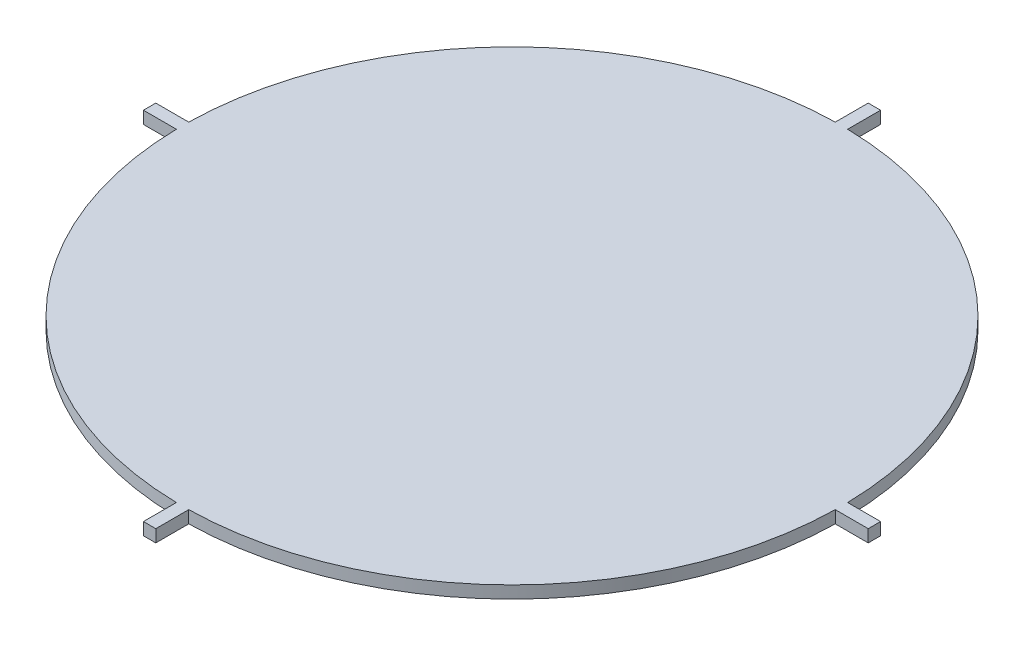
ISO-10303-21;
HEADER;
FILE_DESCRIPTION(('STEP AP214'),'2;1');
FILE_NAME('part.step','',(''),(''),'','','');
FILE_SCHEMA(('AUTOMOTIVE_DESIGN { 1 0 10303 214 1 1 1 1 }'));
ENDSEC;
DATA;
#1=APPLICATION_CONTEXT('core data for automotive mechanical design processes');
#2=APPLICATION_PROTOCOL_DEFINITION('international standard','automotive_design',2000,#1);
#3=PRODUCT_CONTEXT('',#1,'mechanical');
#4=PRODUCT('Part','Part','',(#3));
#5=PRODUCT_RELATED_PRODUCT_CATEGORY('part','',(#4));
#6=PRODUCT_DEFINITION_FORMATION('','',#4);
#7=PRODUCT_DEFINITION_CONTEXT('part definition',#1,'design');
#8=PRODUCT_DEFINITION('design','',#6,#7);
#9=PRODUCT_DEFINITION_SHAPE('','',#8);
#10=(LENGTH_UNIT() NAMED_UNIT(*) SI_UNIT(.MILLI.,.METRE.));
#11=(NAMED_UNIT(*) PLANE_ANGLE_UNIT() SI_UNIT($,.RADIAN.));
#12=(NAMED_UNIT(*) SI_UNIT($,.STERADIAN.) SOLID_ANGLE_UNIT());
#13=UNCERTAINTY_MEASURE_WITH_UNIT(LENGTH_MEASURE(1.E-05),#10,'distance_accuracy_value','');
#14=(GEOMETRIC_REPRESENTATION_CONTEXT(3) GLOBAL_UNCERTAINTY_ASSIGNED_CONTEXT((#13)) GLOBAL_UNIT_ASSIGNED_CONTEXT((#10,
#11,#12)) REPRESENTATION_CONTEXT('',''));
#15=CARTESIAN_POINT('',(0.,0.,0.));
#16=DIRECTION('',(0.,0.,1.));
#17=DIRECTION('',(1.,0.,0.));
#18=AXIS2_PLACEMENT_3D('',#15,#16,#17);
#19=CARTESIAN_POINT('',(0.,3.,-1.50000000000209));
#20=DIRECTION('',(0.,0.,1.));
#21=DIRECTION('',(1.,0.,0.));
#22=AXIS2_PLACEMENT_3D('',#19,#20,#21);
#23=PLANE('',#22);
#24=DIRECTION('',(-1.,0.,0.));
#25=VECTOR('',#24,1.);
#26=CARTESIAN_POINT('',(0.,0.,-1.50000000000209));
#27=LINE('',#26,#25);
#28=CARTESIAN_POINT('',(87.9859362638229,0.,-1.5000000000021));
#29=VERTEX_POINT('',#28);
#30=CARTESIAN_POINT('',(79.9859362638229,0.,-1.5000000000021));
#31=VERTEX_POINT('',#30);
#32=EDGE_CURVE('E181',#29,#31,#27,.T.);
#33=ORIENTED_EDGE('',*,*,#32,.T.);
#34=DIRECTION('',(0.,-1.,0.));
#35=VECTOR('',#34,1.);
#36=CARTESIAN_POINT('',(79.9859362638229,3.,-1.5000000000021));
#37=LINE('',#36,#35);
#38=CARTESIAN_POINT('',(79.9859362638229,3.,-1.5000000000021));
#39=VERTEX_POINT('',#38);
#40=EDGE_CURVE('E11',#39,#31,#37,.T.);
#41=ORIENTED_EDGE('',*,*,#40,.F.);
#42=DIRECTION('',(-1.,0.,0.));
#43=VECTOR('',#42,1.);
#44=CARTESIAN_POINT('',(0.,3.,-1.50000000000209));
#45=LINE('',#44,#43);
#46=CARTESIAN_POINT('',(87.9859362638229,3.,-1.5000000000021));
#47=VERTEX_POINT('',#46);
#48=EDGE_CURVE('E222',#47,#39,#45,.T.);
#49=ORIENTED_EDGE('',*,*,#48,.F.);
#50=DIRECTION('',(0.,-1.,0.));
#51=VECTOR('',#50,1.);
#52=CARTESIAN_POINT('',(87.9859362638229,3.,-1.5000000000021));
#53=LINE('',#52,#51);
#54=EDGE_CURVE('E51',#47,#29,#53,.T.);
#55=ORIENTED_EDGE('',*,*,#54,.T.);
#56=EDGE_LOOP('',(#33,#41,#49,#55));
#57=FACE_BOUND('',#56,.T.);
#58=ADVANCED_FACE('F35',(#57),#23,.F.);
#59=CARTESIAN_POINT('',(0.,3.,0.));
#60=DIRECTION('',(0.,-1.,0.));
#61=DIRECTION('',(0.,0.,-1.));
#62=AXIS2_PLACEMENT_3D('',#59,#60,#61);
#63=CYLINDRICAL_SURFACE('',#62,80.0000000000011);
#64=CARTESIAN_POINT('',(0.,0.,0.));
#65=DIRECTION('',(0.,1.,0.));
#66=DIRECTION('',(0.,0.,1.));
#67=AXIS2_PLACEMENT_3D('',#64,#65,#66);
#68=CIRCLE('',#67,80.0000000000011);
#69=CARTESIAN_POINT('',(1.50000000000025,0.,-79.9859362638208));
#70=VERTEX_POINT('',#69);
#71=EDGE_CURVE('E183',#31,#70,#68,.T.);
#72=ORIENTED_EDGE('',*,*,#71,.T.);
#73=DIRECTION('',(0.,-1.,0.));
#74=VECTOR('',#73,1.);
#75=CARTESIAN_POINT('',(1.50000000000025,3.,-79.9859362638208));
#76=LINE('',#75,#74);
#77=CARTESIAN_POINT('',(1.50000000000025,3.,-79.9859362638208));
#78=VERTEX_POINT('',#77);
#79=EDGE_CURVE('E43',#78,#70,#76,.T.);
#80=ORIENTED_EDGE('',*,*,#79,.F.);
#81=CARTESIAN_POINT('',(0.,3.,0.));
#82=DIRECTION('',(0.,1.,0.));
#83=DIRECTION('',(0.,0.,1.));
#84=AXIS2_PLACEMENT_3D('',#81,#82,#83);
#85=CIRCLE('',#84,80.0000000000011);
#86=EDGE_CURVE('E113',#39,#78,#85,.T.);
#87=ORIENTED_EDGE('',*,*,#86,.F.);
#88=ORIENTED_EDGE('',*,*,#40,.T.);
#89=EDGE_LOOP('',(#72,#80,#87,#88));
#90=FACE_BOUND('',#89,.T.);
#91=ADVANCED_FACE('F253',(#90),#63,.T.);
#92=CARTESIAN_POINT('',(1.49999999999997,3.,0.));
#93=DIRECTION('',(1.,0.,0.));
#94=DIRECTION('',(0.,0.,-1.));
#95=AXIS2_PLACEMENT_3D('',#92,#93,#94);
#96=PLANE('',#95);
#97=DIRECTION('',(0.,0.,1.));
#98=VECTOR('',#97,1.);
#99=CARTESIAN_POINT('',(1.49999999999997,0.,0.));
#100=LINE('',#99,#98);
#101=CARTESIAN_POINT('',(1.50000000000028,0.,-87.9859362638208));
#102=VERTEX_POINT('',#101);
#103=EDGE_CURVE('E186',#102,#70,#100,.T.);
#104=ORIENTED_EDGE('',*,*,#103,.F.);
#105=DIRECTION('',(0.,-1.,0.));
#106=VECTOR('',#105,1.);
#107=CARTESIAN_POINT('',(1.50000000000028,3.,-87.9859362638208));
#108=LINE('',#107,#106);
#109=CARTESIAN_POINT('',(1.50000000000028,3.,-87.9859362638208));
#110=VERTEX_POINT('',#109);
#111=EDGE_CURVE('E246',#110,#102,#108,.T.);
#112=ORIENTED_EDGE('',*,*,#111,.F.);
#113=DIRECTION('',(0.,0.,1.));
#114=VECTOR('',#113,1.);
#115=CARTESIAN_POINT('',(1.49999999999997,3.,0.));
#116=LINE('',#115,#114);
#117=EDGE_CURVE('E252',#110,#78,#116,.T.);
#118=ORIENTED_EDGE('',*,*,#117,.T.);
#119=ORIENTED_EDGE('',*,*,#79,.T.);
#120=EDGE_LOOP('',(#104,#112,#118,#119));
#121=FACE_BOUND('',#120,.T.);
#122=ADVANCED_FACE('F250',(#121),#96,.T.);
#123=CARTESIAN_POINT('',(0.,3.,-87.9859362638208));
#124=DIRECTION('',(0.,0.,-1.));
#125=DIRECTION('',(-1.,0.,0.));
#126=AXIS2_PLACEMENT_3D('',#123,#124,#125);
#127=PLANE('',#126);
#128=DIRECTION('',(1.,0.,0.));
#129=VECTOR('',#128,1.);
#130=CARTESIAN_POINT('',(0.,0.,-87.9859362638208));
#131=LINE('',#130,#129);
#132=CARTESIAN_POINT('',(-1.49999999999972,0.,-87.9859362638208));
#133=VERTEX_POINT('',#132);
#134=EDGE_CURVE('E189',#133,#102,#131,.T.);
#135=ORIENTED_EDGE('',*,*,#134,.F.);
#136=DIRECTION('',(0.,-1.,0.));
#137=VECTOR('',#136,1.);
#138=CARTESIAN_POINT('',(-1.49999999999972,3.,-87.9859362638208));
#139=LINE('',#138,#137);
#140=CARTESIAN_POINT('',(-1.49999999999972,3.,-87.9859362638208));
#141=VERTEX_POINT('',#140);
#142=EDGE_CURVE('E244',#141,#133,#139,.T.);
#143=ORIENTED_EDGE('',*,*,#142,.F.);
#144=DIRECTION('',(1.,0.,0.));
#145=VECTOR('',#144,1.);
#146=CARTESIAN_POINT('',(0.,3.,-87.9859362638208));
#147=LINE('',#146,#145);
#148=EDGE_CURVE('E265',#141,#110,#147,.T.);
#149=ORIENTED_EDGE('',*,*,#148,.T.);
#150=ORIENTED_EDGE('',*,*,#111,.T.);
#151=EDGE_LOOP('',(#135,#143,#149,#150));
#152=FACE_BOUND('',#151,.T.);
#153=ADVANCED_FACE('F261',(#152),#127,.T.);
#154=CARTESIAN_POINT('',(-1.50000000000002,3.,0.));
#155=DIRECTION('',(1.,0.,0.));
#156=DIRECTION('',(0.,0.,-1.));
#157=AXIS2_PLACEMENT_3D('',#154,#155,#156);
#158=PLANE('',#157);
#159=DIRECTION('',(0.,0.,1.));
#160=VECTOR('',#159,1.);
#161=CARTESIAN_POINT('',(-1.50000000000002,0.,0.));
#162=LINE('',#161,#160);
#163=CARTESIAN_POINT('',(-1.49999999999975,0.,-79.9859362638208));
#164=VERTEX_POINT('',#163);
#165=EDGE_CURVE('E192',#133,#164,#162,.T.);
#166=ORIENTED_EDGE('',*,*,#165,.T.);
#167=DIRECTION('',(0.,-1.,0.));
#168=VECTOR('',#167,1.);
#169=CARTESIAN_POINT('',(-1.49999999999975,3.,-79.9859362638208));
#170=LINE('',#169,#168);
#171=CARTESIAN_POINT('',(-1.49999999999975,3.,-79.9859362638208));
#172=VERTEX_POINT('',#171);
#173=EDGE_CURVE('E241',#172,#164,#170,.T.);
#174=ORIENTED_EDGE('',*,*,#173,.F.);
#175=DIRECTION('',(0.,0.,1.));
#176=VECTOR('',#175,1.);
#177=CARTESIAN_POINT('',(-1.50000000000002,3.,0.));
#178=LINE('',#177,#176);
#179=EDGE_CURVE('E267',#141,#172,#178,.T.);
#180=ORIENTED_EDGE('',*,*,#179,.F.);
#181=ORIENTED_EDGE('',*,*,#142,.T.);
#182=EDGE_LOOP('',(#166,#174,#180,#181));
#183=FACE_BOUND('',#182,.T.);
#184=ADVANCED_FACE('F421',(#183),#158,.F.);
#185=CARTESIAN_POINT('',(0.,3.,0.));
#186=DIRECTION('',(0.,-1.,0.));
#187=DIRECTION('',(0.,0.,-1.));
#188=AXIS2_PLACEMENT_3D('',#185,#186,#187);
#189=CYLINDRICAL_SURFACE('',#188,80.);
#190=CARTESIAN_POINT('',(0.,0.,0.));
#191=DIRECTION('',(0.,1.,0.));
#192=DIRECTION('',(0.,0.,1.));
#193=AXIS2_PLACEMENT_3D('',#190,#191,#192);
#194=CIRCLE('',#193,80.);
#195=CARTESIAN_POINT('',(-79.9859362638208,0.,-1.49999999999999));
#196=VERTEX_POINT('',#195);
#197=EDGE_CURVE('E194',#164,#196,#194,.T.);
#198=ORIENTED_EDGE('',*,*,#197,.T.);
#199=DIRECTION('',(0.,-1.,0.));
#200=VECTOR('',#199,1.);
#201=CARTESIAN_POINT('',(-79.9859362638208,3.,-1.49999999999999));
#202=LINE('',#201,#200);
#203=CARTESIAN_POINT('',(-79.9859362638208,3.,-1.49999999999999));
#204=VERTEX_POINT('',#203);
#205=EDGE_CURVE('E239',#204,#196,#202,.T.);
#206=ORIENTED_EDGE('',*,*,#205,.F.);
#207=CARTESIAN_POINT('',(0.,3.,0.));
#208=DIRECTION('',(0.,1.,0.));
#209=DIRECTION('',(0.,0.,1.));
#210=AXIS2_PLACEMENT_3D('',#207,#208,#209);
#211=CIRCLE('',#210,80.);
#212=EDGE_CURVE('E273',#172,#204,#211,.T.);
#213=ORIENTED_EDGE('',*,*,#212,.F.);
#214=ORIENTED_EDGE('',*,*,#173,.T.);
#215=EDGE_LOOP('',(#198,#206,#213,#214));
#216=FACE_BOUND('',#215,.T.);
#217=ADVANCED_FACE('F411',(#216),#189,.T.);
#218=CARTESIAN_POINT('',(0.,3.,-1.49999999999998));
#219=DIRECTION('',(0.,0.,-1.));
#220=DIRECTION('',(-1.,0.,0.));
#221=AXIS2_PLACEMENT_3D('',#218,#219,#220);
#222=PLANE('',#221);
#223=DIRECTION('',(1.,0.,0.));
#224=VECTOR('',#223,1.);
#225=CARTESIAN_POINT('',(0.,0.,-1.49999999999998));
#226=LINE('',#225,#224);
#227=CARTESIAN_POINT('',(-87.9859362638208,0.,-1.49999999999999));
#228=VERTEX_POINT('',#227);
#229=EDGE_CURVE('E197',#228,#196,#226,.T.);
#230=ORIENTED_EDGE('',*,*,#229,.F.);
#231=DIRECTION('',(0.,-1.,0.));
#232=VECTOR('',#231,1.);
#233=CARTESIAN_POINT('',(-87.9859362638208,3.,-1.49999999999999));
#234=LINE('',#233,#232);
#235=CARTESIAN_POINT('',(-87.9859362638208,3.,-1.49999999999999));
#236=VERTEX_POINT('',#235);
#237=EDGE_CURVE('E237',#236,#228,#234,.T.);
#238=ORIENTED_EDGE('',*,*,#237,.F.);
#239=DIRECTION('',(1.,0.,0.));
#240=VECTOR('',#239,1.);
#241=CARTESIAN_POINT('',(0.,3.,-1.49999999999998));
#242=LINE('',#241,#240);
#243=EDGE_CURVE('E275',#236,#204,#242,.T.);
#244=ORIENTED_EDGE('',*,*,#243,.T.);
#245=ORIENTED_EDGE('',*,*,#205,.T.);
#246=EDGE_LOOP('',(#230,#238,#244,#245));
#247=FACE_BOUND('',#246,.T.);
#248=ADVANCED_FACE('F401',(#247),#222,.T.);
#249=CARTESIAN_POINT('',(-87.9859362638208,3.,0.));
#250=DIRECTION('',(-1.,0.,0.));
#251=DIRECTION('',(0.,0.,1.));
#252=AXIS2_PLACEMENT_3D('',#249,#250,#251);
#253=PLANE('',#252);
#254=DIRECTION('',(0.,0.,-1.));
#255=VECTOR('',#254,1.);
#256=CARTESIAN_POINT('',(-87.9859362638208,0.,0.));
#257=LINE('',#256,#255);
#258=CARTESIAN_POINT('',(-87.9859362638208,0.,1.50000000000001));
#259=VERTEX_POINT('',#258);
#260=EDGE_CURVE('E200',#259,#228,#257,.T.);
#261=ORIENTED_EDGE('',*,*,#260,.F.);
#262=DIRECTION('',(0.,-1.,0.));
#263=VECTOR('',#262,1.);
#264=CARTESIAN_POINT('',(-87.9859362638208,3.,1.50000000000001));
#265=LINE('',#264,#263);
#266=CARTESIAN_POINT('',(-87.9859362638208,3.,1.50000000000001));
#267=VERTEX_POINT('',#266);
#268=EDGE_CURVE('E235',#267,#259,#265,.T.);
#269=ORIENTED_EDGE('',*,*,#268,.F.);
#270=DIRECTION('',(0.,0.,-1.));
#271=VECTOR('',#270,1.);
#272=CARTESIAN_POINT('',(-87.9859362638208,3.,0.));
#273=LINE('',#272,#271);
#274=EDGE_CURVE('E278',#267,#236,#273,.T.);
#275=ORIENTED_EDGE('',*,*,#274,.T.);
#276=ORIENTED_EDGE('',*,*,#237,.T.);
#277=EDGE_LOOP('',(#261,#269,#275,#276));
#278=FACE_BOUND('',#277,.T.);
#279=ADVANCED_FACE('F391',(#278),#253,.T.);
#280=CARTESIAN_POINT('',(0.,3.,1.50000000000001));
#281=DIRECTION('',(0.,0.,-1.));
#282=DIRECTION('',(-1.,0.,0.));
#283=AXIS2_PLACEMENT_3D('',#280,#281,#282);
#284=PLANE('',#283);
#285=DIRECTION('',(1.,0.,0.));
#286=VECTOR('',#285,1.);
#287=CARTESIAN_POINT('',(0.,0.,1.50000000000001));
#288=LINE('',#287,#286);
#289=CARTESIAN_POINT('',(-79.9859362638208,0.,1.50000000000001));
#290=VERTEX_POINT('',#289);
#291=EDGE_CURVE('E203',#259,#290,#288,.T.);
#292=ORIENTED_EDGE('',*,*,#291,.T.);
#293=DIRECTION('',(0.,-1.,0.));
#294=VECTOR('',#293,1.);
#295=CARTESIAN_POINT('',(-79.9859362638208,3.,1.50000000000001));
#296=LINE('',#295,#294);
#297=CARTESIAN_POINT('',(-79.9859362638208,3.,1.50000000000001));
#298=VERTEX_POINT('',#297);
#299=EDGE_CURVE('E232',#298,#290,#296,.T.);
#300=ORIENTED_EDGE('',*,*,#299,.F.);
#301=DIRECTION('',(1.,0.,0.));
#302=VECTOR('',#301,1.);
#303=CARTESIAN_POINT('',(0.,3.,1.50000000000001));
#304=LINE('',#303,#302);
#305=EDGE_CURVE('E281',#267,#298,#304,.T.);
#306=ORIENTED_EDGE('',*,*,#305,.F.);
#307=ORIENTED_EDGE('',*,*,#268,.T.);
#308=EDGE_LOOP('',(#292,#300,#306,#307));
#309=FACE_BOUND('',#308,.T.);
#310=ADVANCED_FACE('F381',(#309),#284,.F.);
#311=CARTESIAN_POINT('',(0.,3.,0.));
#312=DIRECTION('',(0.,-1.,0.));
#313=DIRECTION('',(0.,0.,-1.));
#314=AXIS2_PLACEMENT_3D('',#311,#312,#313);
#315=CYLINDRICAL_SURFACE('',#314,80.);
#316=CARTESIAN_POINT('',(0.,0.,0.));
#317=DIRECTION('',(0.,1.,0.));
#318=DIRECTION('',(0.,0.,1.));
#319=AXIS2_PLACEMENT_3D('',#316,#317,#318);
#320=CIRCLE('',#319,80.);
#321=CARTESIAN_POINT('',(-1.50000000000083,0.,79.9859362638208));
#322=VERTEX_POINT('',#321);
#323=EDGE_CURVE('E205',#290,#322,#320,.T.);
#324=ORIENTED_EDGE('',*,*,#323,.T.);
#325=DIRECTION('',(0.,-1.,0.));
#326=VECTOR('',#325,1.);
#327=CARTESIAN_POINT('',(-1.50000000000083,3.,79.9859362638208));
#328=LINE('',#327,#326);
#329=CARTESIAN_POINT('',(-1.50000000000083,3.,79.9859362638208));
#330=VERTEX_POINT('',#329);
#331=EDGE_CURVE('E230',#330,#322,#328,.T.);
#332=ORIENTED_EDGE('',*,*,#331,.F.);
#333=CARTESIAN_POINT('',(0.,3.,0.));
#334=DIRECTION('',(0.,1.,0.));
#335=DIRECTION('',(0.,0.,1.));
#336=AXIS2_PLACEMENT_3D('',#333,#334,#335);
#337=CIRCLE('',#336,80.);
#338=EDGE_CURVE('E283',#298,#330,#337,.T.);
#339=ORIENTED_EDGE('',*,*,#338,.F.);
#340=ORIENTED_EDGE('',*,*,#299,.T.);
#341=EDGE_LOOP('',(#324,#332,#339,#340));
#342=FACE_BOUND('',#341,.T.);
#343=ADVANCED_FACE('F371',(#342),#315,.T.);
#344=CARTESIAN_POINT('',(-1.49999999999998,3.,0.));
#345=DIRECTION('',(-1.,0.,0.));
#346=DIRECTION('',(0.,0.,1.));
#347=AXIS2_PLACEMENT_3D('',#344,#345,#346);
#348=PLANE('',#347);
#349=DIRECTION('',(0.,0.,-1.));
#350=VECTOR('',#349,1.);
#351=CARTESIAN_POINT('',(-1.49999999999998,0.,0.));
#352=LINE('',#351,#350);
#353=CARTESIAN_POINT('',(-1.50000000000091,0.,87.9859362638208));
#354=VERTEX_POINT('',#353);
#355=EDGE_CURVE('E208',#354,#322,#352,.T.);
#356=ORIENTED_EDGE('',*,*,#355,.F.);
#357=DIRECTION('',(0.,-1.,0.));
#358=VECTOR('',#357,1.);
#359=CARTESIAN_POINT('',(-1.50000000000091,3.,87.9859362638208));
#360=LINE('',#359,#358);
#361=CARTESIAN_POINT('',(-1.50000000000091,3.,87.9859362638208));
#362=VERTEX_POINT('',#361);
#363=EDGE_CURVE('E228',#362,#354,#360,.T.);
#364=ORIENTED_EDGE('',*,*,#363,.F.);
#365=DIRECTION('',(0.,0.,-1.));
#366=VECTOR('',#365,1.);
#367=CARTESIAN_POINT('',(-1.49999999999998,3.,0.));
#368=LINE('',#367,#366);
#369=EDGE_CURVE('E285',#362,#330,#368,.T.);
#370=ORIENTED_EDGE('',*,*,#369,.T.);
#371=ORIENTED_EDGE('',*,*,#331,.T.);
#372=EDGE_LOOP('',(#356,#364,#370,#371));
#373=FACE_BOUND('',#372,.T.);
#374=ADVANCED_FACE('F298',(#373),#348,.T.);
#375=CARTESIAN_POINT('',(-8.14033435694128E-13,3.,87.9859362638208));
#376=DIRECTION('',(0.,0.,1.));
#377=DIRECTION('',(1.,0.,0.));
#378=AXIS2_PLACEMENT_3D('',#375,#376,#377);
#379=PLANE('',#378);
#380=DIRECTION('',(-1.,0.,0.));
#381=VECTOR('',#380,1.);
#382=CARTESIAN_POINT('',(-8.14033435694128E-13,0.,87.9859362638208));
#383=LINE('',#382,#381);
#384=CARTESIAN_POINT('',(1.49999999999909,0.,87.9859362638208));
#385=VERTEX_POINT('',#384);
#386=EDGE_CURVE('E211',#385,#354,#383,.T.);
#387=ORIENTED_EDGE('',*,*,#386,.F.);
#388=DIRECTION('',(0.,-1.,0.));
#389=VECTOR('',#388,1.);
#390=CARTESIAN_POINT('',(1.49999999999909,3.,87.9859362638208));
#391=LINE('',#390,#389);
#392=CARTESIAN_POINT('',(1.49999999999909,3.,87.9859362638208));
#393=VERTEX_POINT('',#392);
#394=EDGE_CURVE('E226',#393,#385,#391,.T.);
#395=ORIENTED_EDGE('',*,*,#394,.F.);
#396=DIRECTION('',(-1.,0.,0.));
#397=VECTOR('',#396,1.);
#398=CARTESIAN_POINT('',(-8.14033435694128E-13,3.,87.9859362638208));
#399=LINE('',#398,#397);
#400=EDGE_CURVE('E288',#393,#362,#399,.T.);
#401=ORIENTED_EDGE('',*,*,#400,.T.);
#402=ORIENTED_EDGE('',*,*,#363,.T.);
#403=EDGE_LOOP('',(#387,#395,#401,#402));
#404=FACE_BOUND('',#403,.T.);
#405=ADVANCED_FACE('F292',(#404),#379,.T.);
#406=CARTESIAN_POINT('',(1.50000000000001,3.,0.));
#407=DIRECTION('',(-1.,0.,0.));
#408=DIRECTION('',(0.,0.,1.));
#409=AXIS2_PLACEMENT_3D('',#406,#407,#408);
#410=PLANE('',#409);
#411=DIRECTION('',(0.,0.,-1.));
#412=VECTOR('',#411,1.);
#413=CARTESIAN_POINT('',(1.50000000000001,0.,0.));
#414=LINE('',#413,#412);
#415=CARTESIAN_POINT('',(1.49999999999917,0.,79.9859362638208));
#416=VERTEX_POINT('',#415);
#417=EDGE_CURVE('E214',#385,#416,#414,.T.);
#418=ORIENTED_EDGE('',*,*,#417,.T.);
#419=DIRECTION('',(0.,-1.,0.));
#420=VECTOR('',#419,1.);
#421=CARTESIAN_POINT('',(1.49999999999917,3.,79.9859362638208));
#422=LINE('',#421,#420);
#423=CARTESIAN_POINT('',(1.49999999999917,3.,79.9859362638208));
#424=VERTEX_POINT('',#423);
#425=EDGE_CURVE('E173',#424,#416,#422,.T.);
#426=ORIENTED_EDGE('',*,*,#425,.F.);
#427=DIRECTION('',(0.,0.,-1.));
#428=VECTOR('',#427,1.);
#429=CARTESIAN_POINT('',(1.50000000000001,3.,0.));
#430=LINE('',#429,#428);
#431=EDGE_CURVE('E161',#393,#424,#430,.T.);
#432=ORIENTED_EDGE('',*,*,#431,.F.);
#433=ORIENTED_EDGE('',*,*,#394,.T.);
#434=EDGE_LOOP('',(#418,#426,#432,#433));
#435=FACE_BOUND('',#434,.T.);
#436=ADVANCED_FACE('F302',(#435),#410,.F.);
#437=CARTESIAN_POINT('',(0.,3.,0.));
#438=DIRECTION('',(0.,-1.,0.));
#439=DIRECTION('',(0.,0.,-1.));
#440=AXIS2_PLACEMENT_3D('',#437,#438,#439);
#441=CYLINDRICAL_SURFACE('',#440,80.0000000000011);
#442=CARTESIAN_POINT('',(0.,0.,0.));
#443=DIRECTION('',(0.,1.,0.));
#444=DIRECTION('',(0.,0.,1.));
#445=AXIS2_PLACEMENT_3D('',#442,#443,#444);
#446=CIRCLE('',#445,80.0000000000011);
#447=CARTESIAN_POINT('',(79.9859362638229,0.,1.4999999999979));
#448=VERTEX_POINT('',#447);
#449=EDGE_CURVE('E170',#416,#448,#446,.T.);
#450=ORIENTED_EDGE('',*,*,#449,.T.);
#451=DIRECTION('',(0.,-1.,0.));
#452=VECTOR('',#451,1.);
#453=CARTESIAN_POINT('',(79.9859362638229,3.,1.4999999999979));
#454=LINE('',#453,#452);
#455=CARTESIAN_POINT('',(79.9859362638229,3.,1.4999999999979));
#456=VERTEX_POINT('',#455);
#457=EDGE_CURVE('E167',#456,#448,#454,.T.);
#458=ORIENTED_EDGE('',*,*,#457,.F.);
#459=CARTESIAN_POINT('',(0.,3.,0.));
#460=DIRECTION('',(0.,1.,0.));
#461=DIRECTION('',(0.,0.,1.));
#462=AXIS2_PLACEMENT_3D('',#459,#460,#461);
#463=CIRCLE('',#462,80.0000000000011);
#464=EDGE_CURVE('E153',#424,#456,#463,.T.);
#465=ORIENTED_EDGE('',*,*,#464,.F.);
#466=ORIENTED_EDGE('',*,*,#425,.T.);
#467=EDGE_LOOP('',(#450,#458,#465,#466));
#468=FACE_BOUND('',#467,.T.);
#469=ADVANCED_FACE('F168',(#468),#441,.T.);
#470=CARTESIAN_POINT('',(0.,3.,1.49999999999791));
#471=DIRECTION('',(0.,0.,1.));
#472=DIRECTION('',(1.,0.,0.));
#473=AXIS2_PLACEMENT_3D('',#470,#471,#472);
#474=PLANE('',#473);
#475=DIRECTION('',(-1.,0.,0.));
#476=VECTOR('',#475,1.);
#477=CARTESIAN_POINT('',(0.,0.,1.49999999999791));
#478=LINE('',#477,#476);
#479=CARTESIAN_POINT('',(87.9859362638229,0.,1.4999999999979));
#480=VERTEX_POINT('',#479);
#481=EDGE_CURVE('E217',#480,#448,#478,.T.);
#482=ORIENTED_EDGE('',*,*,#481,.F.);
#483=DIRECTION('',(0.,-1.,0.));
#484=VECTOR('',#483,1.);
#485=CARTESIAN_POINT('',(87.9859362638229,3.,1.4999999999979));
#486=LINE('',#485,#484);
#487=CARTESIAN_POINT('',(87.9859362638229,3.,1.4999999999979));
#488=VERTEX_POINT('',#487);
#489=EDGE_CURVE('E101',#488,#480,#486,.T.);
#490=ORIENTED_EDGE('',*,*,#489,.F.);
#491=DIRECTION('',(-1.,0.,0.));
#492=VECTOR('',#491,1.);
#493=CARTESIAN_POINT('',(0.,3.,1.49999999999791));
#494=LINE('',#493,#492);
#495=EDGE_CURVE('E158',#488,#456,#494,.T.);
#496=ORIENTED_EDGE('',*,*,#495,.T.);
#497=ORIENTED_EDGE('',*,*,#457,.T.);
#498=EDGE_LOOP('',(#482,#490,#496,#497));
#499=FACE_BOUND('',#498,.T.);
#500=ADVANCED_FACE('F175',(#499),#474,.T.);
#501=CARTESIAN_POINT('',(87.9859362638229,3.,4.07016717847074E-13));
#502=DIRECTION('',(1.,0.,0.));
#503=DIRECTION('',(0.,0.,-1.));
#504=AXIS2_PLACEMENT_3D('',#501,#502,#503);
#505=PLANE('',#504);
#506=DIRECTION('',(0.,0.,1.));
#507=VECTOR('',#506,1.);
#508=CARTESIAN_POINT('',(87.9859362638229,0.,4.07016717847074E-13));
#509=LINE('',#508,#507);
#510=EDGE_CURVE('E219',#29,#480,#509,.T.);
#511=ORIENTED_EDGE('',*,*,#510,.F.);
#512=ORIENTED_EDGE('',*,*,#54,.F.);
#513=DIRECTION('',(0.,0.,1.));
#514=VECTOR('',#513,1.);
#515=CARTESIAN_POINT('',(87.9859362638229,3.,4.07016717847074E-13));
#516=LINE('',#515,#514);
#517=EDGE_CURVE('E176',#47,#488,#516,.T.);
#518=ORIENTED_EDGE('',*,*,#517,.T.);
#519=ORIENTED_EDGE('',*,*,#489,.T.);
#520=EDGE_LOOP('',(#511,#512,#518,#519));
#521=FACE_BOUND('',#520,.T.);
#522=ADVANCED_FACE('F315',(#521),#505,.T.);
#523=CARTESIAN_POINT('',(0.,3.,0.));
#524=DIRECTION('',(0.,1.,0.));
#525=DIRECTION('',(0.,0.,1.));
#526=AXIS2_PLACEMENT_3D('',#523,#524,#525);
#527=PLANE('',#526);
#528=ORIENTED_EDGE('',*,*,#48,.T.);
#529=ORIENTED_EDGE('',*,*,#86,.T.);
#530=ORIENTED_EDGE('',*,*,#117,.F.);
#531=ORIENTED_EDGE('',*,*,#148,.F.);
#532=ORIENTED_EDGE('',*,*,#179,.T.);
#533=ORIENTED_EDGE('',*,*,#212,.T.);
#534=ORIENTED_EDGE('',*,*,#243,.F.);
#535=ORIENTED_EDGE('',*,*,#274,.F.);
#536=ORIENTED_EDGE('',*,*,#305,.T.);
#537=ORIENTED_EDGE('',*,*,#338,.T.);
#538=ORIENTED_EDGE('',*,*,#369,.F.);
#539=ORIENTED_EDGE('',*,*,#400,.F.);
#540=ORIENTED_EDGE('',*,*,#431,.T.);
#541=ORIENTED_EDGE('',*,*,#464,.T.);
#542=ORIENTED_EDGE('',*,*,#495,.F.);
#543=ORIENTED_EDGE('',*,*,#517,.F.);
#544=EDGE_LOOP('',(#528,#529,#530,#531,#532,#533,#534,#535,#536,#537,#538,#539,#540,#541,#542,#543));
#545=FACE_BOUND('',#544,.T.);
#546=ADVANCED_FACE('F155',(#545),#527,.T.);
#547=CARTESIAN_POINT('',(0.,0.,0.));
#548=DIRECTION('',(0.,1.,0.));
#549=DIRECTION('',(0.,0.,1.));
#550=AXIS2_PLACEMENT_3D('',#547,#548,#549);
#551=PLANE('',#550);
#552=ORIENTED_EDGE('',*,*,#32,.F.);
#553=ORIENTED_EDGE('',*,*,#510,.T.);
#554=ORIENTED_EDGE('',*,*,#481,.T.);
#555=ORIENTED_EDGE('',*,*,#449,.F.);
#556=ORIENTED_EDGE('',*,*,#417,.F.);
#557=ORIENTED_EDGE('',*,*,#386,.T.);
#558=ORIENTED_EDGE('',*,*,#355,.T.);
#559=ORIENTED_EDGE('',*,*,#323,.F.);
#560=ORIENTED_EDGE('',*,*,#291,.F.);
#561=ORIENTED_EDGE('',*,*,#260,.T.);
#562=ORIENTED_EDGE('',*,*,#229,.T.);
#563=ORIENTED_EDGE('',*,*,#197,.F.);
#564=ORIENTED_EDGE('',*,*,#165,.F.);
#565=ORIENTED_EDGE('',*,*,#134,.T.);
#566=ORIENTED_EDGE('',*,*,#103,.T.);
#567=ORIENTED_EDGE('',*,*,#71,.F.);
#568=EDGE_LOOP('',(#552,#553,#554,#555,#556,#557,#558,#559,#560,#561,#562,#563,#564,#565,#566,#567));
#569=FACE_BOUND('',#568,.T.);
#570=ADVANCED_FACE('F256',(#569),#551,.F.);
#571=CLOSED_SHELL('',(#58,#91,#122,#153,#184,#217,#248,#279,#310,#343,#374,#405,#436,#469,#500,
#522,#546,#570));
#572=MANIFOLD_SOLID_BREP('B2',#571);
#573=ADVANCED_BREP_SHAPE_REPRESENTATION('',(#18,#572),#14);
#574=SHAPE_DEFINITION_REPRESENTATION(#9,#573);
ENDSEC;
END-ISO-10303-21;
